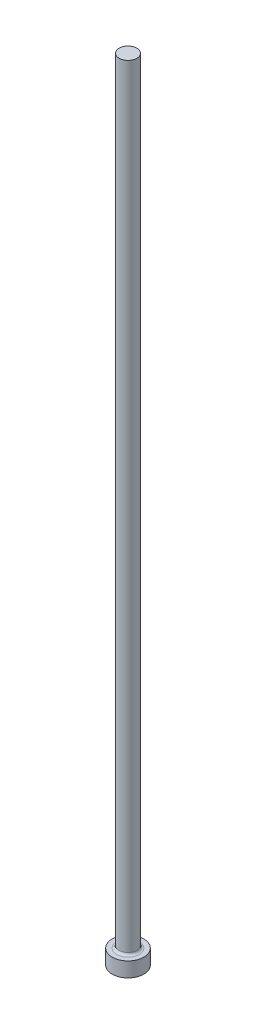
ISO-10303-21;
HEADER;
FILE_DESCRIPTION(('STEP AP214'),'2;1');
FILE_NAME('part.step','',(''),(''),'','','');
FILE_SCHEMA(('AUTOMOTIVE_DESIGN { 1 0 10303 214 1 1 1 1 }'));
ENDSEC;
DATA;
#1=APPLICATION_CONTEXT('core data for automotive mechanical design processes');
#2=APPLICATION_PROTOCOL_DEFINITION('international standard','automotive_design',2000,#1);
#3=PRODUCT_CONTEXT('',#1,'mechanical');
#4=PRODUCT('Part','Part','',(#3));
#5=PRODUCT_RELATED_PRODUCT_CATEGORY('part','',(#4));
#6=PRODUCT_DEFINITION_FORMATION('','',#4);
#7=PRODUCT_DEFINITION_CONTEXT('part definition',#1,'design');
#8=PRODUCT_DEFINITION('design','',#6,#7);
#9=PRODUCT_DEFINITION_SHAPE('','',#8);
#10=(LENGTH_UNIT() NAMED_UNIT(*) SI_UNIT(.MILLI.,.METRE.));
#11=(NAMED_UNIT(*) PLANE_ANGLE_UNIT() SI_UNIT($,.RADIAN.));
#12=(NAMED_UNIT(*) SI_UNIT($,.STERADIAN.) SOLID_ANGLE_UNIT());
#13=UNCERTAINTY_MEASURE_WITH_UNIT(LENGTH_MEASURE(1.E-05),#10,'distance_accuracy_value','');
#14=(GEOMETRIC_REPRESENTATION_CONTEXT(3) GLOBAL_UNCERTAINTY_ASSIGNED_CONTEXT((#13)) GLOBAL_UNIT_ASSIGNED_CONTEXT((#10,
#11,#12)) REPRESENTATION_CONTEXT('',''));
#15=CARTESIAN_POINT('',(0.,0.,0.));
#16=DIRECTION('',(0.,0.,1.));
#17=DIRECTION('',(1.,0.,0.));
#18=AXIS2_PLACEMENT_3D('',#15,#16,#17);
#19=CARTESIAN_POINT('',(2.84099,254.,0.));
#20=DIRECTION('',(0.,-1.,0.));
#21=DIRECTION('',(1.,0.,0.));
#22=AXIS2_PLACEMENT_3D('',#19,#20,#21);
#23=PLANE('',#22);
#24=CARTESIAN_POINT('',(0.,254.,0.));
#25=DIRECTION('',(0.,1.,0.));
#26=DIRECTION('',(-1.,0.,0.));
#27=AXIS2_PLACEMENT_3D('',#24,#25,#26);
#28=CIRCLE('',#27,2.84099000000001);
#29=CARTESIAN_POINT('',(-2.84099000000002,254.,0.));
#30=VERTEX_POINT('',#29);
#31=EDGE_CURVE('E10',#30,#30,#28,.T.);
#32=ORIENTED_EDGE('',*,*,#31,.T.);
#33=EDGE_LOOP('',(#32));
#34=FACE_BOUND('',#33,.T.);
#35=ADVANCED_FACE('F30',(#34),#23,.F.);
#36=CARTESIAN_POINT('',(0.,254.,0.));
#37=DIRECTION('',(0.,1.,0.));
#38=DIRECTION('',(-1.,0.,0.));
#39=AXIS2_PLACEMENT_3D('',#36,#37,#38);
#40=CYLINDRICAL_SURFACE('',#39,2.84099000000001);
#41=ORIENTED_EDGE('',*,*,#31,.F.);
#42=EDGE_LOOP('',(#41));
#43=FACE_BOUND('',#42,.T.);
#44=CARTESIAN_POINT('',(0.,5.51180000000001,0.));
#45=DIRECTION('',(0.,1.,0.));
#46=DIRECTION('',(-1.,0.,0.));
#47=AXIS2_PLACEMENT_3D('',#44,#45,#46);
#48=CIRCLE('',#47,2.84099);
#49=CARTESIAN_POINT('',(-2.84099,5.51180000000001,0.));
#50=VERTEX_POINT('',#49);
#51=EDGE_CURVE('E36',#50,#50,#48,.T.);
#52=ORIENTED_EDGE('',*,*,#51,.T.);
#53=EDGE_LOOP('',(#52));
#54=FACE_BOUND('',#53,.T.);
#55=ADVANCED_FACE('F65',(#43,#54),#40,.T.);
#56=CARTESIAN_POINT('',(0.,5.5118,0.));
#57=DIRECTION('',(0.,1.,0.));
#58=DIRECTION('',(-1.,0.,0.));
#59=AXIS2_PLACEMENT_3D('',#56,#57,#58);
#60=TOROIDAL_SURFACE('',#59,3.60299,0.762);
#61=ORIENTED_EDGE('',*,*,#51,.F.);
#62=EDGE_LOOP('',(#61));
#63=FACE_BOUND('',#62,.T.);
#64=CARTESIAN_POINT('',(0.,4.7498,0.));
#65=DIRECTION('',(0.,1.,0.));
#66=DIRECTION('',(-1.,0.,0.));
#67=AXIS2_PLACEMENT_3D('',#64,#65,#66);
#68=CIRCLE('',#67,3.60299);
#69=CARTESIAN_POINT('',(-3.60299,4.7498,0.));
#70=VERTEX_POINT('',#69);
#71=EDGE_CURVE('E40',#70,#70,#68,.T.);
#72=ORIENTED_EDGE('',*,*,#71,.T.);
#73=EDGE_LOOP('',(#72));
#74=FACE_BOUND('',#73,.T.);
#75=ADVANCED_FACE('F69',(#63,#74),#60,.F.);
#76=CARTESIAN_POINT('',(5.08,4.7498,0.));
#77=DIRECTION('',(0.,-1.,0.));
#78=DIRECTION('',(1.,0.,0.));
#79=AXIS2_PLACEMENT_3D('',#76,#77,#78);
#80=PLANE('',#79);
#81=ORIENTED_EDGE('',*,*,#71,.F.);
#82=EDGE_LOOP('',(#81));
#83=FACE_BOUND('',#82,.T.);
#84=CARTESIAN_POINT('',(0.,4.7498,0.));
#85=DIRECTION('',(0.,1.,0.));
#86=DIRECTION('',(-1.,0.,0.));
#87=AXIS2_PLACEMENT_3D('',#84,#85,#86);
#88=CIRCLE('',#87,5.08);
#89=CARTESIAN_POINT('',(-5.08,4.7498,0.));
#90=VERTEX_POINT('',#89);
#91=EDGE_CURVE('E44',#90,#90,#88,.T.);
#92=ORIENTED_EDGE('',*,*,#91,.T.);
#93=EDGE_LOOP('',(#92));
#94=FACE_BOUND('',#93,.T.);
#95=ADVANCED_FACE('F61',(#83,#94),#80,.F.);
#96=CARTESIAN_POINT('',(0.,254.,0.));
#97=DIRECTION('',(0.,1.,0.));
#98=DIRECTION('',(-1.,0.,0.));
#99=AXIS2_PLACEMENT_3D('',#96,#97,#98);
#100=CYLINDRICAL_SURFACE('',#99,5.08);
#101=ORIENTED_EDGE('',*,*,#91,.F.);
#102=EDGE_LOOP('',(#101));
#103=FACE_BOUND('',#102,.T.);
#104=CARTESIAN_POINT('',(0.,0.,0.));
#105=DIRECTION('',(0.,1.,0.));
#106=DIRECTION('',(-1.,0.,0.));
#107=AXIS2_PLACEMENT_3D('',#104,#105,#106);
#108=CIRCLE('',#107,5.08);
#109=CARTESIAN_POINT('',(-5.08,0.,0.));
#110=VERTEX_POINT('',#109);
#111=EDGE_CURVE('E49',#110,#110,#108,.T.);
#112=ORIENTED_EDGE('',*,*,#111,.T.);
#113=EDGE_LOOP('',(#112));
#114=FACE_BOUND('',#113,.T.);
#115=ADVANCED_FACE('F53',(#103,#114),#100,.T.);
#116=CARTESIAN_POINT('',(0.,0.,0.));
#117=DIRECTION('',(0.,1.,0.));
#118=DIRECTION('',(-1.,0.,0.));
#119=AXIS2_PLACEMENT_3D('',#116,#117,#118);
#120=PLANE('',#119);
#121=ORIENTED_EDGE('',*,*,#111,.F.);
#122=EDGE_LOOP('',(#121));
#123=FACE_BOUND('',#122,.T.);
#124=ADVANCED_FACE('F55',(#123),#120,.F.);
#125=CLOSED_SHELL('',(#35,#55,#75,#95,#115,#124));
#126=MANIFOLD_SOLID_BREP('B2',#125);
#127=ADVANCED_BREP_SHAPE_REPRESENTATION('',(#18,#126),#14);
#128=SHAPE_DEFINITION_REPRESENTATION(#9,#127);
ENDSEC;
END-ISO-10303-21;
